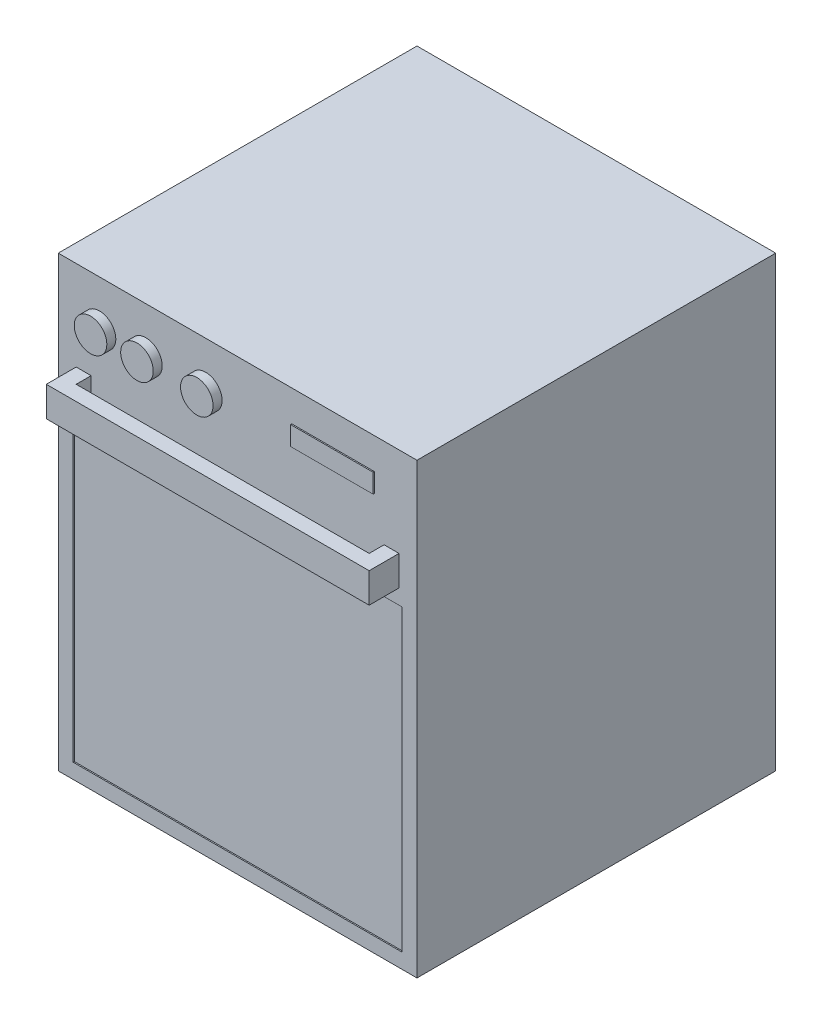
from build123d import *

# Parameters (mm, degrees)
ESQUISSE1_W             = 600
ESQUISSE1_H             = 750
BOSS_EXTRU_1_DEPTH      = 600
ESQUISSE2_W             = 540
ESQUISSE2_H             = 50
BOSS_EXTRU_2_DEPTH      = 50
ESQUISSE3_W             = 490
ESQUISSE3_H             = 25
ENL_V_MAT_EXTRU_1_DEPTH = 50
ESQUISSE4_W             = 550
ESQUISSE4_H             = 500
ENL_V_MAT_EXTRU_2_DEPTH = 2
ESQUISSE5_R             = 27.236565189
BOSS_EXTRU_3_DEPTH      = 15
ESQUISSE6_W             = 138.384009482
ESQUISSE6_H             = 31.816117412
BOSS_EXTRU_4_DEPTH      = 2


with BuildPart() as part:
    # Esquisse1 → Boss.-Extru.1 (new body)
    with BuildSketch(Plane.XY):
        with Locations((300, 375)):
            Rectangle(ESQUISSE1_W, ESQUISSE1_H)
    extrude(amount=BOSS_EXTRU_1_DEPTH)

    # Esquisse2 → Boss.-Extru.2 (add)
    with BuildSketch(Plane.XY.offset(600)):
        with Locations((300, 575)):
            Rectangle(ESQUISSE2_W, ESQUISSE2_H)
    extrude(amount=BOSS_EXTRU_2_DEPTH)

    # Esquisse3 → Enl_v. mat.-Extru.1 (cut)
    with BuildSketch(Plane(origin=(0, 600, 0), x_dir=(1, 0, 0), z_dir=(0, 1, 0))):
        with Locations((300, -612.5)):
            Rectangle(ESQUISSE3_W, ESQUISSE3_H)
    extrude(amount=-ENL_V_MAT_EXTRU_1_DEPTH, mode=Mode.SUBTRACT)

    # Esquisse4 → Enl_v. mat.-Extru.2 (cut)
    with BuildSketch(Plane.XY.offset(600)):
        with Locations((300, 275)):
            Rectangle(ESQUISSE4_W, ESQUISSE4_H)
    extrude(amount=-ENL_V_MAT_EXTRU_2_DEPTH, mode=Mode.SUBTRACT)

    # Esquisse5 → Boss.-Extru.3 (add)
    with BuildSketch(Plane.XY.offset(600)):
        with Locations(Location((69.009374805, 673.51273932, 0), (0, 0, 180))):
            Circle(ESQUISSE5_R)
        with Locations(Location((146.635573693, 673.51273932, 0), (0, 0, 180))):
            Circle(ESQUISSE5_R)
        with Locations(Location((246.747834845, 673.51273932, 0), (0, 0, 180))):
            Circle(ESQUISSE5_R)
    extrude(amount=BOSS_EXTRU_3_DEPTH)

    # Esquisse6 → Boss.-Extru.4 (add)
    with BuildSketch(Plane.XY.offset(600)):
        with Locations((459.524795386, 682.030968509)):
            Rectangle(ESQUISSE6_W, ESQUISSE6_H)
    extrude(amount=BOSS_EXTRU_4_DEPTH)


solid = part.part
